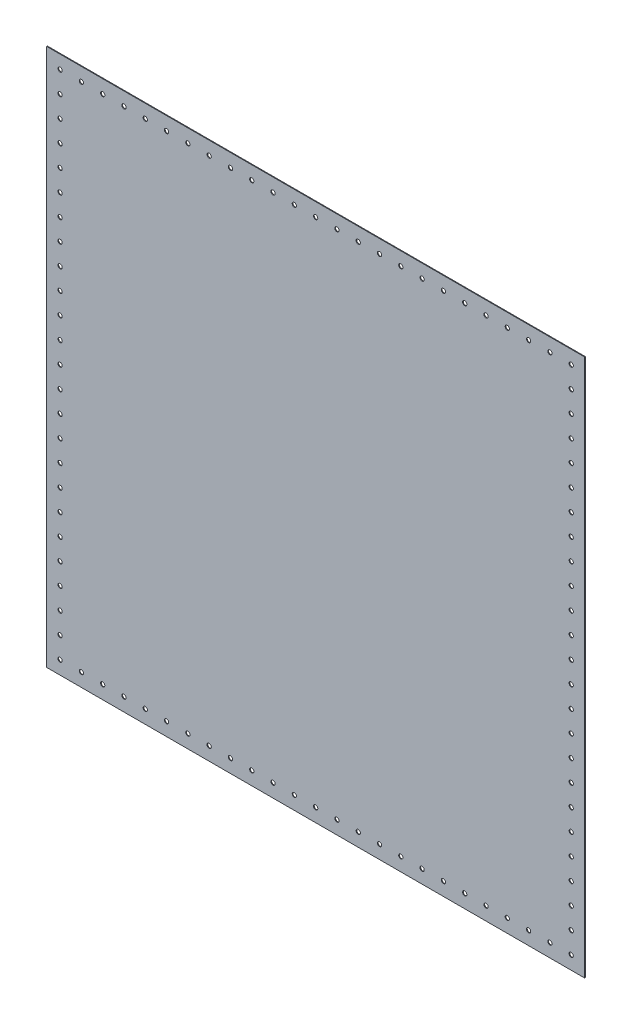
from build123d import *

# Parameters (mm, degrees)
SK_47_986IN_PNL_W  = 1218.8444
SK_47_986IN_PNL_H  = 1218.8444
PANEL_DEPTH        = 1.5875
SK_5DIA_HOLE_PAT_R = 4.826
RIVET_HOLES_DEPTH  = 1.5875


with BuildPart() as part:
    # sk 47.986in pnl → Panel (new body)
    with BuildSketch(Plane(origin=(0, 0, 0), x_dir=(0, 1, 0), z_dir=(0, 0, 1))):
        Rectangle(SK_47_986IN_PNL_W, SK_47_986IN_PNL_H)
    extrude(amount=PANEL_DEPTH)

    # sk 5dia hole pat → Rivet Holes (cut)
    with BuildSketch(Plane(origin=(0, 0, 0), x_dir=(0, 1, 0), z_dir=(0, 0, 1))):
        with Locations(Location((-579.12, -579.12, 0), (0, 0, 270))):
            Circle(SK_5DIA_HOLE_PAT_R)
        with Locations(Location((579.12, 579.12, 0), (0, 0, 270))):
            Circle(SK_5DIA_HOLE_PAT_R)
        with Locations(Location((-530.86, -579.12, 0), (0, 0, 270))):
            Circle(SK_5DIA_HOLE_PAT_R)
        with Locations(Location((-482.6, -579.12, 0), (0, 0, 270))):
            Circle(SK_5DIA_HOLE_PAT_R)
        with Locations(Location((-434.34, -579.12, 0), (0, 0, 270))):
            Circle(SK_5DIA_HOLE_PAT_R)
        with Locations(Location((-386.08, -579.12, 0), (0, 0, 270))):
            Circle(SK_5DIA_HOLE_PAT_R)
        with Locations(Location((-337.82, -579.12, 0), (0, 0, 270))):
            Circle(SK_5DIA_HOLE_PAT_R)
        with Locations(Location((-289.56, -579.12, 0), (0, 0, 270))):
            Circle(SK_5DIA_HOLE_PAT_R)
        with Locations(Location((-241.3, -579.12, 0), (0, 0, 270))):
            Circle(SK_5DIA_HOLE_PAT_R)
        with Locations(Location((-193.04, -579.12, 0), (0, 0, 270))):
            Circle(SK_5DIA_HOLE_PAT_R)
        with Locations(Location((-144.78, -579.12, 0), (0, 0, 270))):
            Circle(SK_5DIA_HOLE_PAT_R)
        with Locations(Location((-96.52, -579.12, 0), (0, 0, 270))):
            Circle(SK_5DIA_HOLE_PAT_R)
        with Locations(Location((-48.26, -579.12, 0), (0, 0, 270))):
            Circle(SK_5DIA_HOLE_PAT_R)
        with Locations(Location((0, -579.12, 0), (0, 0, 270))):
            Circle(SK_5DIA_HOLE_PAT_R)
        with Locations(Location((48.26, -579.12, 0), (0, 0, 270))):
            Circle(SK_5DIA_HOLE_PAT_R)
        with Locations(Location((96.52, -579.12, 0), (0, 0, 270))):
            Circle(SK_5DIA_HOLE_PAT_R)
        with Locations(Location((144.78, -579.12, 0), (0, 0, 270))):
            Circle(SK_5DIA_HOLE_PAT_R)
        with Locations(Location((193.04, -579.12, 0), (0, 0, 270))):
            Circle(SK_5DIA_HOLE_PAT_R)
        with Locations(Location((241.3, -579.12, 0), (0, 0, 270))):
            Circle(SK_5DIA_HOLE_PAT_R)
        with Locations(Location((289.56, -579.12, 0), (0, 0, 270))):
            Circle(SK_5DIA_HOLE_PAT_R)
        with Locations(Location((337.82, -579.12, 0), (0, 0, 270))):
            Circle(SK_5DIA_HOLE_PAT_R)
        with Locations(Location((386.08, -579.12, 0), (0, 0, 270))):
            Circle(SK_5DIA_HOLE_PAT_R)
        with Locations(Location((434.34, -579.12, 0), (0, 0, 270))):
            Circle(SK_5DIA_HOLE_PAT_R)
        with Locations(Location((482.6, -579.12, 0), (0, 0, 270))):
            Circle(SK_5DIA_HOLE_PAT_R)
        with Locations(Location((530.86, -579.12, 0), (0, 0, 270))):
            Circle(SK_5DIA_HOLE_PAT_R)
        with Locations(Location((579.12, -579.12, 0), (0, 0, 270))):
            Circle(SK_5DIA_HOLE_PAT_R)
        with Locations(Location((-579.12, -530.86, 0), (0, 0, 270))):
            Circle(SK_5DIA_HOLE_PAT_R)
        with Locations(Location((-579.12, -482.6, 0), (0, 0, 270))):
            Circle(SK_5DIA_HOLE_PAT_R)
        with Locations(Location((-579.12, -434.34, 0), (0, 0, 270))):
            Circle(SK_5DIA_HOLE_PAT_R)
        with Locations(Location((-579.12, -386.08, 0), (0, 0, 270))):
            Circle(SK_5DIA_HOLE_PAT_R)
        with Locations(Location((-579.12, -337.82, 0), (0, 0, 270))):
            Circle(SK_5DIA_HOLE_PAT_R)
        with Locations(Location((-579.12, -289.56, 0), (0, 0, 270))):
            Circle(SK_5DIA_HOLE_PAT_R)
        with Locations(Location((-579.12, -241.3, 0), (0, 0, 270))):
            Circle(SK_5DIA_HOLE_PAT_R)
        with Locations(Location((-579.12, -193.04, 0), (0, 0, 270))):
            Circle(SK_5DIA_HOLE_PAT_R)
        with Locations(Location((-579.12, -144.78, 0), (0, 0, 270))):
            Circle(SK_5DIA_HOLE_PAT_R)
        with Locations(Location((-579.12, -96.52, 0), (0, 0, 270))):
            Circle(SK_5DIA_HOLE_PAT_R)
        with Locations(Location((-579.12, -48.26, 0), (0, 0, 270))):
            Circle(SK_5DIA_HOLE_PAT_R)
        with Locations(Location((-579.12, 0, 0), (0, 0, 270))):
            Circle(SK_5DIA_HOLE_PAT_R)
        with Locations(Location((-579.12, 48.26, 0), (0, 0, 270))):
            Circle(SK_5DIA_HOLE_PAT_R)
        with Locations(Location((-579.12, 96.52, 0), (0, 0, 270))):
            Circle(SK_5DIA_HOLE_PAT_R)
        with Locations(Location((-579.12, 144.78, 0), (0, 0, 270))):
            Circle(SK_5DIA_HOLE_PAT_R)
        with Locations(Location((-579.12, 193.04, 0), (0, 0, 270))):
            Circle(SK_5DIA_HOLE_PAT_R)
        with Locations(Location((-579.12, 241.3, 0), (0, 0, 270))):
            Circle(SK_5DIA_HOLE_PAT_R)
        with Locations(Location((-579.12, 289.56, 0), (0, 0, 270))):
            Circle(SK_5DIA_HOLE_PAT_R)
        with Locations(Location((-579.12, 337.82, 0), (0, 0, 270))):
            Circle(SK_5DIA_HOLE_PAT_R)
        with Locations(Location((-579.12, 386.08, 0), (0, 0, 270))):
            Circle(SK_5DIA_HOLE_PAT_R)
        with Locations(Location((-579.12, 434.34, 0), (0, 0, 270))):
            Circle(SK_5DIA_HOLE_PAT_R)
        with Locations(Location((-579.12, 482.6, 0), (0, 0, 270))):
            Circle(SK_5DIA_HOLE_PAT_R)
        with Locations(Location((-579.12, 530.86, 0), (0, 0, 270))):
            Circle(SK_5DIA_HOLE_PAT_R)
        with Locations(Location((-579.12, 579.12, 0), (0, 0, 270))):
            Circle(SK_5DIA_HOLE_PAT_R)
        with Locations(Location((530.86, 579.12, 0), (0, 0, 270))):
            Circle(SK_5DIA_HOLE_PAT_R)
        with Locations(Location((482.6, 579.12, 0), (0, 0, 270))):
            Circle(SK_5DIA_HOLE_PAT_R)
        with Locations(Location((434.34, 579.12, 0), (0, 0, 270))):
            Circle(SK_5DIA_HOLE_PAT_R)
        with Locations(Location((386.08, 579.12, 0), (0, 0, 270))):
            Circle(SK_5DIA_HOLE_PAT_R)
        with Locations(Location((337.82, 579.12, 0), (0, 0, 270))):
            Circle(SK_5DIA_HOLE_PAT_R)
        with Locations(Location((289.56, 579.12, 0), (0, 0, 270))):
            Circle(SK_5DIA_HOLE_PAT_R)
        with Locations(Location((241.3, 579.12, 0), (0, 0, 270))):
            Circle(SK_5DIA_HOLE_PAT_R)
        with Locations(Location((193.04, 579.12, 0), (0, 0, 270))):
            Circle(SK_5DIA_HOLE_PAT_R)
        with Locations(Location((144.78, 579.12, 0), (0, 0, 270))):
            Circle(SK_5DIA_HOLE_PAT_R)
        with Locations(Location((96.52, 579.12, 0), (0, 0, 270))):
            Circle(SK_5DIA_HOLE_PAT_R)
        with Locations(Location((48.26, 579.12, 0), (0, 0, 270))):
            Circle(SK_5DIA_HOLE_PAT_R)
        with Locations(Location((0, 579.12, 0), (0, 0, 270))):
            Circle(SK_5DIA_HOLE_PAT_R)
        with Locations(Location((-48.26, 579.12, 0), (0, 0, 270))):
            Circle(SK_5DIA_HOLE_PAT_R)
        with Locations(Location((-96.52, 579.12, 0), (0, 0, 270))):
            Circle(SK_5DIA_HOLE_PAT_R)
        with Locations(Location((-144.78, 579.12, 0), (0, 0, 270))):
            Circle(SK_5DIA_HOLE_PAT_R)
        with Locations(Location((-193.04, 579.12, 0), (0, 0, 270))):
            Circle(SK_5DIA_HOLE_PAT_R)
        with Locations(Location((-241.3, 579.12, 0), (0, 0, 270))):
            Circle(SK_5DIA_HOLE_PAT_R)
        with Locations(Location((-289.56, 579.12, 0), (0, 0, 270))):
            Circle(SK_5DIA_HOLE_PAT_R)
        with Locations(Location((-337.82, 579.12, 0), (0, 0, 270))):
            Circle(SK_5DIA_HOLE_PAT_R)
        with Locations(Location((-386.08, 579.12, 0), (0, 0, 270))):
            Circle(SK_5DIA_HOLE_PAT_R)
        with Locations(Location((-434.34, 579.12, 0), (0, 0, 270))):
            Circle(SK_5DIA_HOLE_PAT_R)
        with Locations(Location((-482.6, 579.12, 0), (0, 0, 270))):
            Circle(SK_5DIA_HOLE_PAT_R)
        with Locations(Location((-530.86, 579.12, 0), (0, 0, 270))):
            Circle(SK_5DIA_HOLE_PAT_R)
        with Locations(Location((579.12, 530.86, 0), (0, 0, 270))):
            Circle(SK_5DIA_HOLE_PAT_R)
        with Locations(Location((579.12, 482.6, 0), (0, 0, 270))):
            Circle(SK_5DIA_HOLE_PAT_R)
        with Locations(Location((579.12, 434.34, 0), (0, 0, 270))):
            Circle(SK_5DIA_HOLE_PAT_R)
        with Locations(Location((579.12, 386.08, 0), (0, 0, 270))):
            Circle(SK_5DIA_HOLE_PAT_R)
        with Locations(Location((579.12, 337.82, 0), (0, 0, 270))):
            Circle(SK_5DIA_HOLE_PAT_R)
        with Locations(Location((579.12, 289.56, 0), (0, 0, 270))):
            Circle(SK_5DIA_HOLE_PAT_R)
        with Locations(Location((579.12, 241.3, 0), (0, 0, 270))):
            Circle(SK_5DIA_HOLE_PAT_R)
        with Locations(Location((579.12, 193.04, 0), (0, 0, 270))):
            Circle(SK_5DIA_HOLE_PAT_R)
        with Locations(Location((579.12, 144.78, 0), (0, 0, 270))):
            Circle(SK_5DIA_HOLE_PAT_R)
        with Locations(Location((579.12, 96.52, 0), (0, 0, 270))):
            Circle(SK_5DIA_HOLE_PAT_R)
        with Locations(Location((579.12, 48.26, 0), (0, 0, 270))):
            Circle(SK_5DIA_HOLE_PAT_R)
        with Locations(Location((579.12, 0, 0), (0, 0, 270))):
            Circle(SK_5DIA_HOLE_PAT_R)
        with Locations(Location((579.12, -48.26, 0), (0, 0, 270))):
            Circle(SK_5DIA_HOLE_PAT_R)
        with Locations(Location((579.12, -96.52, 0), (0, 0, 270))):
            Circle(SK_5DIA_HOLE_PAT_R)
        with Locations(Location((579.12, -144.78, 0), (0, 0, 270))):
            Circle(SK_5DIA_HOLE_PAT_R)
        with Locations(Location((579.12, -193.04, 0), (0, 0, 270))):
            Circle(SK_5DIA_HOLE_PAT_R)
        with Locations(Location((579.12, -241.3, 0), (0, 0, 270))):
            Circle(SK_5DIA_HOLE_PAT_R)
        with Locations(Location((579.12, -289.56, 0), (0, 0, 270))):
            Circle(SK_5DIA_HOLE_PAT_R)
        with Locations(Location((579.12, -337.82, 0), (0, 0, 270))):
            Circle(SK_5DIA_HOLE_PAT_R)
        with Locations(Location((579.12, -386.08, 0), (0, 0, 270))):
            Circle(SK_5DIA_HOLE_PAT_R)
        with Locations(Location((579.12, -434.34, 0), (0, 0, 270))):
            Circle(SK_5DIA_HOLE_PAT_R)
        with Locations(Location((579.12, -482.6, 0), (0, 0, 270))):
            Circle(SK_5DIA_HOLE_PAT_R)
        with Locations(Location((579.12, -530.86, 0), (0, 0, 270))):
            Circle(SK_5DIA_HOLE_PAT_R)
    extrude(amount=RIVET_HOLES_DEPTH, mode=Mode.SUBTRACT)


solid = part.part
